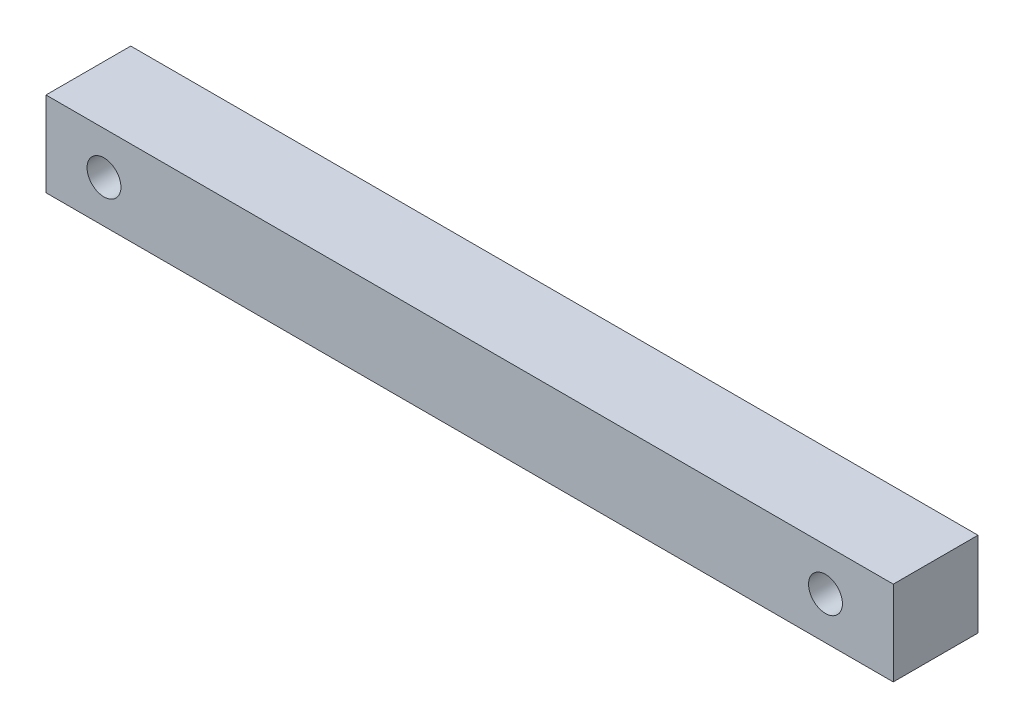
from build123d import *

# Parameters (mm, degrees)
SKETCH1_W           = 50
SKETCH1_H           = 5
BOSS_EXTRUDE1_DEPTH = 5
SKETCH2_R           = 1
CUT_EXTRUDE1_DEPTH  = 5


with BuildPart() as part:
    # Sketch1 → Boss-Extrude1 (new body)
    with BuildSketch(Plane.XY):
        Rectangle(SKETCH1_W, SKETCH1_H)
    extrude(amount=BOSS_EXTRUDE1_DEPTH)

    # Sketch2 → Cut-Extrude1 (cut)
    with BuildSketch(Plane.XY.offset(5)):
        with Locations((-21.578, 0)):
            Circle(SKETCH2_R)
        with Locations((21, 0)):
            Circle(SKETCH2_R)
    extrude(amount=-CUT_EXTRUDE1_DEPTH, mode=Mode.SUBTRACT)


solid = part.part
